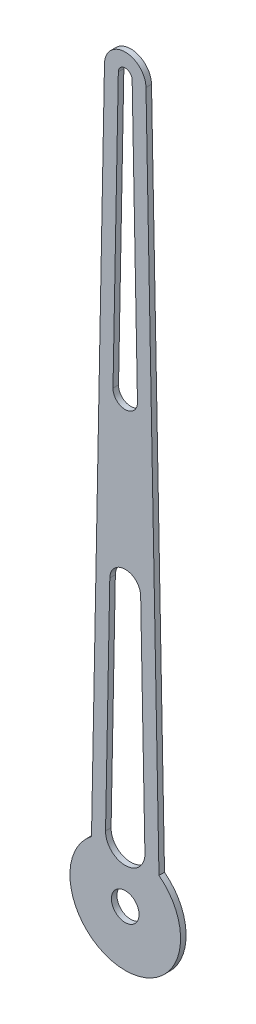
from build123d import *

# Parameters (mm, degrees)
SKETCH2_R          = 0.25
BASE_EXTRUDE_DEPTH = 0.1


with BuildPart() as part:
    # Sketch2 → Base-Extrude (new body)
    with BuildSketch(Plane.XY):
        with BuildLine():
            Line((0.374930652, 13.007211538), (0.609872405, 0.792499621))
            ThreePointArc((0.609872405, 0.792499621), (0, -1), (-0.609872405, 0.792499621))
            Line((-0.609872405, 0.792499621), (-0.374930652, 13.007211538))
            ThreePointArc((-0.374930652, 13.007211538), (0, 13.375), (0.374930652, 13.007211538))
        make_face()
        Circle(SKETCH2_R, mode=Mode.SUBTRACT)
        with BuildLine():
            Line((0.124976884, 13.002403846), (0.221112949, 8.004252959))
            ThreePointArc((0.221112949, 8.004252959), (0, 7.778846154), (-0.221112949, 8.004252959))
            Line((-0.221112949, 8.004252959), (-0.124976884, 13.002403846))
            ThreePointArc((-0.124976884, 13.002403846), (0, 13.125), (0.124976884, 13.002403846))
        make_face(mode=Mode.SUBTRACT)
        with BuildLine():
            Line((-0.278794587, 5.005362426), (-0.355703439, 1.006841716))
            ThreePointArc((-0.355703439, 1.006841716), (0, 0.644230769), (0.355703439, 1.006841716))
            Line((0.355703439, 1.006841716), (0.278794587, 5.005362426))
            ThreePointArc((0.278794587, 5.005362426), (0, 5.278846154), (-0.278794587, 5.005362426))
        make_face(mode=Mode.SUBTRACT)
    extrude(amount=BASE_EXTRUDE_DEPTH)


solid = part.part
